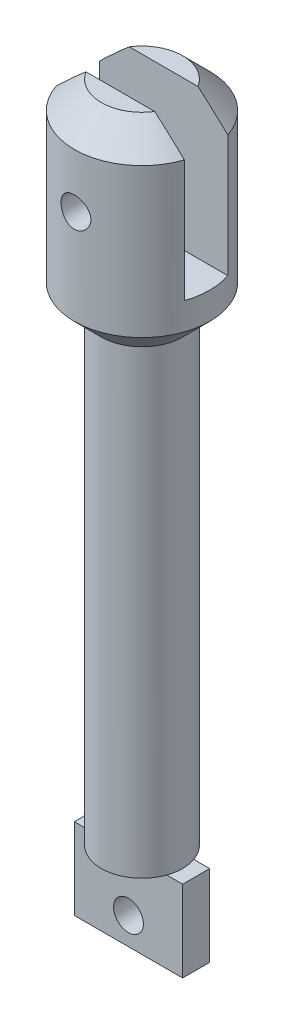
ISO-10303-21;
HEADER;
FILE_DESCRIPTION(('STEP AP214'),'2;1');
FILE_NAME('part.step','',(''),(''),'','','');
FILE_SCHEMA(('AUTOMOTIVE_DESIGN { 1 0 10303 214 1 1 1 1 }'));
ENDSEC;
DATA;
#1=APPLICATION_CONTEXT('core data for automotive mechanical design processes');
#2=APPLICATION_PROTOCOL_DEFINITION('international standard','automotive_design',2000,#1);
#3=PRODUCT_CONTEXT('',#1,'mechanical');
#4=PRODUCT('Part','Part','',(#3));
#5=PRODUCT_RELATED_PRODUCT_CATEGORY('part','',(#4));
#6=PRODUCT_DEFINITION_FORMATION('','',#4);
#7=PRODUCT_DEFINITION_CONTEXT('part definition',#1,'design');
#8=PRODUCT_DEFINITION('design','',#6,#7);
#9=PRODUCT_DEFINITION_SHAPE('','',#8);
#10=(LENGTH_UNIT() NAMED_UNIT(*) SI_UNIT(.MILLI.,.METRE.));
#11=(NAMED_UNIT(*) PLANE_ANGLE_UNIT() SI_UNIT($,.RADIAN.));
#12=(NAMED_UNIT(*) SI_UNIT($,.STERADIAN.) SOLID_ANGLE_UNIT());
#13=UNCERTAINTY_MEASURE_WITH_UNIT(LENGTH_MEASURE(1.E-05),#10,'distance_accuracy_value','');
#14=(GEOMETRIC_REPRESENTATION_CONTEXT(3) GLOBAL_UNCERTAINTY_ASSIGNED_CONTEXT((#13)) GLOBAL_UNIT_ASSIGNED_CONTEXT((#10,
#11,#12)) REPRESENTATION_CONTEXT('',''));
#15=CARTESIAN_POINT('',(0.,0.,0.));
#16=DIRECTION('',(0.,0.,1.));
#17=DIRECTION('',(1.,0.,0.));
#18=AXIS2_PLACEMENT_3D('',#15,#16,#17);
#19=CARTESIAN_POINT('',(0.,16.,0.));
#20=DIRECTION('',(0.,1.,0.));
#21=DIRECTION('',(0.,0.,1.));
#22=AXIS2_PLACEMENT_3D('',#19,#20,#21);
#23=PLANE('',#22);
#24=DIRECTION('',(1.,0.,0.));
#25=VECTOR('',#24,1.);
#26=CARTESIAN_POINT('',(-2.75,16.,0.8));
#27=LINE('',#26,#25);
#28=CARTESIAN_POINT('',(-1.26885775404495,16.,0.8));
#29=VERTEX_POINT('',#28);
#30=CARTESIAN_POINT('',(1.26885775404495,16.,0.8));
#31=VERTEX_POINT('',#30);
#32=EDGE_CURVE('E137',#29,#31,#27,.T.);
#33=ORIENTED_EDGE('',*,*,#32,.F.);
#34=CARTESIAN_POINT('',(0.,16.,0.));
#35=DIRECTION('',(0.,1.,0.));
#36=DIRECTION('',(0.,0.,1.));
#37=AXIS2_PLACEMENT_3D('',#34,#35,#36);
#38=CIRCLE('',#37,1.49999999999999);
#39=EDGE_CURVE('E141',#29,#31,#38,.T.);
#40=ORIENTED_EDGE('',*,*,#39,.T.);
#41=EDGE_LOOP('',(#33,#40));
#42=FACE_BOUND('',#41,.T.);
#43=ADVANCED_FACE('F32',(#42),#23,.T.);
#44=CARTESIAN_POINT('',(0.,16.,0.));
#45=DIRECTION('',(0.,-1.,0.));
#46=DIRECTION('',(0.,0.,-1.));
#47=AXIS2_PLACEMENT_3D('',#44,#45,#46);
#48=CONICAL_SURFACE('',#47,1.49999999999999,0.785398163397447);
#49=CARTESIAN_POINT('',(-5.50175266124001,11.9403882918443,0.8));
#50=CARTESIAN_POINT('',(-5.33857171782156,12.101863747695,0.8));
#51=CARTESIAN_POINT('',(-5.17532333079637,12.2632711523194,0.8));
#52=CARTESIAN_POINT('',(-4.8485497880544,12.5859637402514,0.8));
#53=CARTESIAN_POINT('',(-4.68502453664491,12.7472488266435,0.8));
#54=CARTESIAN_POINT('',(-4.35620866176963,13.071035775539,0.8));
#55=CARTESIAN_POINT('',(-4.19091562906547,13.2335351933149,0.8));
#56=CARTESIAN_POINT('',(-3.86003065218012,13.5580705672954,0.8));
#57=CARTESIAN_POINT('',(-3.69443888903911,13.7201067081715,0.8));
#58=CARTESIAN_POINT('',(-3.30405950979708,14.100842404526,0.8));
#59=CARTESIAN_POINT('',(-3.07904887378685,14.3193140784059,0.8));
#60=CARTESIAN_POINT('',(-2.73997447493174,14.6457832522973,0.8));
#61=CARTESIAN_POINT('',(-2.62659439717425,14.7544903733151,0.8));
#62=CARTESIAN_POINT('',(-2.39918779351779,14.9711862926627,0.8));
#63=CARTESIAN_POINT('',(-2.28516138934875,15.079175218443,0.8));
#64=CARTESIAN_POINT('',(-2.05692600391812,15.2933283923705,0.8));
#65=CARTESIAN_POINT('',(-1.94272407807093,15.3995001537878,0.8));
#66=CARTESIAN_POINT('',(-1.71269786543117,15.6102480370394,0.8));
#67=CARTESIAN_POINT('',(-1.59687250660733,15.7148229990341,0.8));
#68=CARTESIAN_POINT('',(-1.42130237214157,15.8692495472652,0.8));
#69=CARTESIAN_POINT('',(-1.36256436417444,15.9202433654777,0.8));
#70=CARTESIAN_POINT('',(-1.24417038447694,16.0211513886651,0.8));
#71=CARTESIAN_POINT('',(-1.18451447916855,16.0710656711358,0.8));
#72=CARTESIAN_POINT('',(-1.06398610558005,16.1692686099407,0.8));
#73=CARTESIAN_POINT('',(-1.00311506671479,16.217559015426,0.8));
#74=CARTESIAN_POINT('',(-0.879544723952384,16.3117309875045,0.8));
#75=CARTESIAN_POINT('',(-0.816846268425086,16.3576136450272,0.8));
#76=CARTESIAN_POINT('',(-0.735880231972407,16.4130906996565,0.8));
#77=CARTESIAN_POINT('',(-0.718880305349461,16.4245353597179,0.8));
#78=CARTESIAN_POINT('',(-0.684663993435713,16.4470998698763,0.8));
#79=CARTESIAN_POINT('',(-0.667447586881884,16.4582196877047,0.8));
#80=CARTESIAN_POINT('',(-0.615435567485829,16.4910228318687,0.8));
#81=CARTESIAN_POINT('',(-0.580282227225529,16.5121463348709,0.8));
#82=CARTESIAN_POINT('',(-0.509099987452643,16.552200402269,0.8));
#83=CARTESIAN_POINT('',(-0.473080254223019,16.5711470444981,0.8));
#84=CARTESIAN_POINT('',(-0.399723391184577,16.6062761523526,0.8));
#85=CARTESIAN_POINT('',(-0.362386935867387,16.6224600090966,0.8));
#86=CARTESIAN_POINT('',(-0.277278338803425,16.65443116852,0.8));
#87=CARTESIAN_POINT('',(-0.22911724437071,16.6692298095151,0.8));
#88=CARTESIAN_POINT('',(-0.131114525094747,16.6907193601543,0.8));
#89=CARTESIAN_POINT('',(-0.0812803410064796,16.6974422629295,0.8));
#90=CARTESIAN_POINT('',(0.0191115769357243,16.7013503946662,0.8));
#91=CARTESIAN_POINT('',(0.0696719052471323,16.6984737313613,0.8));
#92=CARTESIAN_POINT('',(0.169539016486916,16.6837433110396,0.8));
#93=CARTESIAN_POINT('',(0.218841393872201,16.6718615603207,0.8));
#94=CARTESIAN_POINT('',(0.305925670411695,16.6443014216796,0.8));
#95=CARTESIAN_POINT('',(0.344099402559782,16.6297929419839,0.8));
#96=CARTESIAN_POINT('',(0.419062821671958,16.5975207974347,0.8));
#97=CARTESIAN_POINT('',(0.45585127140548,16.5797543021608,0.8));
#98=CARTESIAN_POINT('',(0.528350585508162,16.5417747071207,0.8));
#99=CARTESIAN_POINT('',(0.564055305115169,16.5215500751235,0.8));
#100=CARTESIAN_POINT('',(0.634399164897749,16.4793768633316,0.8));
#101=CARTESIAN_POINT('',(0.669038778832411,16.4574290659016,0.8));
#102=CARTESIAN_POINT('',(0.744162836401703,16.4078314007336,0.8));
#103=CARTESIAN_POINT('',(0.784464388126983,16.37990623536,0.8));
#104=CARTESIAN_POINT('',(0.864124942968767,16.3227372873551,0.8));
#105=CARTESIAN_POINT('',(0.903483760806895,16.2934932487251,0.8));
#106=CARTESIAN_POINT('',(1.02051570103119,16.2042857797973,0.8));
#107=CARTESIAN_POINT('',(1.09708933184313,16.1428847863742,0.8));
#108=CARTESIAN_POINT('',(1.24856967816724,16.0177286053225,0.8));
#109=CARTESIAN_POINT('',(1.32347193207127,15.9539681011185,0.8));
#110=CARTESIAN_POINT('',(1.47200942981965,15.8250512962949,0.8));
#111=CARTESIAN_POINT('',(1.54564517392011,15.7598955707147,0.8));
#112=CARTESIAN_POINT('',(1.69226241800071,15.6284502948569,0.8));
#113=CARTESIAN_POINT('',(1.7652415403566,15.5621581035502,0.8));
#114=CARTESIAN_POINT('',(1.91058476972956,15.4288895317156,0.8));
#115=CARTESIAN_POINT('',(1.98294881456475,15.3619130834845,0.8));
#116=CARTESIAN_POINT('',(2.19914893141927,15.1604501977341,0.8));
#117=CARTESIAN_POINT('',(2.3423065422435,15.0252365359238,0.8));
#118=CARTESIAN_POINT('',(2.61305699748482,14.7674992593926,0.8));
#119=CARTESIAN_POINT('',(2.74075256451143,14.6450830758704,0.8));
#120=CARTESIAN_POINT('',(2.99556108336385,14.3996424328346,0.8));
#121=CARTESIAN_POINT('',(3.12267402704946,14.2766179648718,0.8));
#122=CARTESIAN_POINT('',(3.50355759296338,13.9067859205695,0.8));
#123=CARTESIAN_POINT('',(3.75672690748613,13.659359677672,0.8));
#124=CARTESIAN_POINT('',(4.25889848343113,13.166886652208,0.8));
#125=CARTESIAN_POINT('',(4.50791186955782,12.9218511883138,0.8));
#126=CARTESIAN_POINT('',(5.00524283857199,12.4313818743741,0.8));
#127=CARTESIAN_POINT('',(5.25356075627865,12.1859483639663,0.8));
#128=CARTESIAN_POINT('',(5.50175266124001,11.9403882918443,0.8));
#129=B_SPLINE_CURVE_WITH_KNOTS('',3,(#49,#50,#51,#52,#53,#54,#55,#56,#57,#58,#59,#60,#61,#62,
#63,#64,#65,#66,#67,#68,#69,#70,#71,#72,#73,#74,#75,#76,#77,#78,#79,#80,#81,#82,#83,#84,#85,#86,
#87,#88,#89,#90,#91,#92,#93,#94,#95,#96,#97,#98,#99,#100,#101,#102,#103,#104,#105,#106,#107,
#108,#109,#110,#111,#112,#113,#114,#115,#116,#117,#118,#119,#120,#121,#122,#123,#124,#125,#126,
#127,#128),.UNSPECIFIED.,.F.,.F.,(4,2,2,2,2,2,2,2,2,2,2,2,2,2,2,2,2,2,2,2,2,2,2,2,2,2,2,2,2,2,2,
2,2,2,2,2,2,2,2,4),(0.,0.68870980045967,1.37775281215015,2.07313025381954,2.76817470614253,
3.70903733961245,4.18025800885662,4.65139269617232,5.11917943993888,5.58729118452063,
5.82063833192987,6.05396867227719,6.28703905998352,6.5200029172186,6.58147970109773,
6.6429625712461,6.76594680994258,6.88795471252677,7.00990099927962,7.16053083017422,
7.31056193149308,7.46156220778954,7.61303382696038,7.73536955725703,7.85781207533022,
7.98085296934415,8.1038383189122,8.25089317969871,8.39797670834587,8.69234364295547,
8.98741994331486,9.28237688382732,9.57815095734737,9.87395458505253,10.4646970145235,
10.995380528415,11.5260714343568,12.5880601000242,13.6361292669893,14.6835509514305),.UNSPECIFIED.);
#130=CARTESIAN_POINT('',(-2.3685438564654,15.,0.8));
#131=VERTEX_POINT('',#130);
#132=EDGE_CURVE('E254',#131,#29,#129,.T.);
#133=ORIENTED_EDGE('',*,*,#132,.F.);
#134=CARTESIAN_POINT('',(0.,15.,0.));
#135=DIRECTION('',(0.,1.,0.));
#136=DIRECTION('',(0.,0.,1.));
#137=AXIS2_PLACEMENT_3D('',#134,#135,#136);
#138=CIRCLE('',#137,2.5);
#139=CARTESIAN_POINT('',(2.3685438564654,15.,0.8));
#140=VERTEX_POINT('',#139);
#141=EDGE_CURVE('E256',#140,#131,#138,.F.);
#142=ORIENTED_EDGE('',*,*,#141,.F.);
#143=EDGE_CURVE('E130',#31,#140,#129,.T.);
#144=ORIENTED_EDGE('',*,*,#143,.F.);
#145=ORIENTED_EDGE('',*,*,#39,.F.);
#146=EDGE_LOOP('',(#133,#142,#144,#145));
#147=FACE_BOUND('',#146,.T.);
#148=ADVANCED_FACE('F240',(#147),#48,.T.);
#149=CARTESIAN_POINT('',(0.,-8.5,0.));
#150=DIRECTION('',(0.,1.,0.));
#151=DIRECTION('',(0.,0.,1.));
#152=AXIS2_PLACEMENT_3D('',#149,#150,#151);
#153=PLANE('',#152);
#154=DIRECTION('',(-1.,0.,0.));
#155=VECTOR('',#154,1.);
#156=CARTESIAN_POINT('',(-2.,-8.5,0.5));
#157=LINE('',#156,#155);
#158=CARTESIAN_POINT('',(1.4142135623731,-8.5,0.5));
#159=VERTEX_POINT('',#158);
#160=CARTESIAN_POINT('',(-1.4142135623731,-8.5,0.5));
#161=VERTEX_POINT('',#160);
#162=EDGE_CURVE('E140',#159,#161,#157,.T.);
#163=ORIENTED_EDGE('',*,*,#162,.F.);
#164=CARTESIAN_POINT('',(0.,-8.5,0.));
#165=DIRECTION('',(0.,1.,0.));
#166=DIRECTION('',(0.,0.,1.));
#167=AXIS2_PLACEMENT_3D('',#164,#165,#166);
#168=CIRCLE('',#167,1.5);
#169=EDGE_CURVE('E306',#161,#159,#168,.T.);
#170=ORIENTED_EDGE('',*,*,#169,.F.);
#171=EDGE_LOOP('',(#163,#170));
#172=FACE_BOUND('',#171,.T.);
#173=ADVANCED_FACE('F245',(#172),#153,.F.);
#174=CARTESIAN_POINT('',(0.,8.5,0.));
#175=DIRECTION('',(0.,-1.,0.));
#176=DIRECTION('',(0.,0.,-1.));
#177=AXIS2_PLACEMENT_3D('',#174,#175,#176);
#178=CYLINDRICAL_SURFACE('',#177,1.5);
#179=CARTESIAN_POINT('',(0.,8.5,0.));
#180=DIRECTION('',(0.,1.,0.));
#181=DIRECTION('',(0.,0.,1.));
#182=AXIS2_PLACEMENT_3D('',#179,#180,#181);
#183=CIRCLE('',#182,1.5);
#184=CARTESIAN_POINT('',(0.,8.5,1.5));
#185=VERTEX_POINT('',#184);
#186=EDGE_CURVE('E307',#185,#185,#183,.T.);
#187=ORIENTED_EDGE('',*,*,#186,.F.);
#188=EDGE_LOOP('',(#187));
#189=FACE_BOUND('',#188,.T.);
#190=CARTESIAN_POINT('',(1.4142135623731,-8.5,-0.5));
#191=VERTEX_POINT('',#190);
#192=EDGE_CURVE('E310',#159,#191,#168,.T.);
#193=ORIENTED_EDGE('',*,*,#192,.T.);
#194=CARTESIAN_POINT('',(-1.4142135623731,-8.5,-0.5));
#195=VERTEX_POINT('',#194);
#196=EDGE_CURVE('E312',#191,#195,#168,.T.);
#197=ORIENTED_EDGE('',*,*,#196,.T.);
#198=EDGE_CURVE('E350',#195,#161,#168,.T.);
#199=ORIENTED_EDGE('',*,*,#198,.T.);
#200=ORIENTED_EDGE('',*,*,#169,.T.);
#201=EDGE_LOOP('',(#193,#197,#199,#200));
#202=FACE_BOUND('',#201,.T.);
#203=ADVANCED_FACE('F322',(#189,#202),#178,.T.);
#204=ORIENTED_EDGE('',*,*,#196,.F.);
#205=DIRECTION('',(-1.,0.,0.));
#206=VECTOR('',#205,1.);
#207=CARTESIAN_POINT('',(-2.,-8.5,-0.5));
#208=LINE('',#207,#206);
#209=EDGE_CURVE('E56',#191,#195,#208,.T.);
#210=ORIENTED_EDGE('',*,*,#209,.T.);
#211=EDGE_LOOP('',(#204,#210));
#212=FACE_BOUND('',#211,.T.);
#213=ADVANCED_FACE('F210',(#212),#153,.F.);
#214=CARTESIAN_POINT('',(0.,16.,0.));
#215=DIRECTION('',(0.,-1.,0.));
#216=DIRECTION('',(0.,0.,-1.));
#217=AXIS2_PLACEMENT_3D('',#214,#215,#216);
#218=CYLINDRICAL_SURFACE('',#217,2.5);
#219=CARTESIAN_POINT('',(0.,13.55,-2.5));
#220=CARTESIAN_POINT('',(-0.0304999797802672,13.5499989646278,-2.49999943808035));
#221=CARTESIAN_POINT('',(-0.0610124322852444,13.5474543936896,-2.49943618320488));
#222=CARTESIAN_POINT('',(-0.121170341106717,13.5373540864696,-2.49724365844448));
#223=CARTESIAN_POINT('',(-0.150815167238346,13.5297947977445,-2.49561363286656));
#224=CARTESIAN_POINT('',(-0.208359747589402,13.5099135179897,-2.49146901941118));
#225=CARTESIAN_POINT('',(-0.236261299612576,13.4975965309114,-2.48895536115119));
#226=CARTESIAN_POINT('',(-0.289600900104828,13.4685654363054,-2.48331463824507));
#227=CARTESIAN_POINT('',(-0.315039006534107,13.4518514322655,-2.48018758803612));
#228=CARTESIAN_POINT('',(-0.363143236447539,13.4142138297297,-2.47360580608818));
#229=CARTESIAN_POINT('',(-0.385763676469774,13.3932325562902,-2.47014697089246));
#230=CARTESIAN_POINT('',(-0.427194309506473,13.3477798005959,-2.46332030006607));
#231=CARTESIAN_POINT('',(-0.446004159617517,13.3233080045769,-2.45995247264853));
#232=CARTESIAN_POINT('',(-0.479481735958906,13.2712304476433,-2.45364864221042));
#233=CARTESIAN_POINT('',(-0.49410073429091,13.243592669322,-2.45071789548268));
#234=CARTESIAN_POINT('',(-0.518469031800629,13.1861775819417,-2.44567899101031));
#235=CARTESIAN_POINT('',(-0.528218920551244,13.1564005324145,-2.44357073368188));
#236=CARTESIAN_POINT('',(-0.542421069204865,13.0960479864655,-2.44045731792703));
#237=CARTESIAN_POINT('',(-0.54695426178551,13.0654924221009,-2.43943532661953));
#238=CARTESIAN_POINT('',(-0.550846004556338,13.0040386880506,-2.43855960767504));
#239=CARTESIAN_POINT('',(-0.550205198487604,12.9731405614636,-2.43870573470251));
#240=CARTESIAN_POINT('',(-0.543832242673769,12.9124811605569,-2.44013450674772));
#241=CARTESIAN_POINT('',(-0.538194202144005,12.8827094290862,-2.44139614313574));
#242=CARTESIAN_POINT('',(-0.522135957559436,12.8245450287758,-2.44488055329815));
#243=CARTESIAN_POINT('',(-0.51171548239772,12.7961524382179,-2.44710338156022));
#244=CARTESIAN_POINT('',(-0.486301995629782,12.7412881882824,-2.45228036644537));
#245=CARTESIAN_POINT('',(-0.471272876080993,12.7148338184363,-2.45524026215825));
#246=CARTESIAN_POINT('',(-0.437094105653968,12.664787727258,-2.4615543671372));
#247=CARTESIAN_POINT('',(-0.41794388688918,12.6411964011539,-2.46490863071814));
#248=CARTESIAN_POINT('',(-0.375568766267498,12.5970043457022,-2.47172360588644));
#249=CARTESIAN_POINT('',(-0.352263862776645,12.5764803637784,-2.47518504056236));
#250=CARTESIAN_POINT('',(-0.302503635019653,12.539619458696,-2.48175751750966));
#251=CARTESIAN_POINT('',(-0.276048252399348,12.5232826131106,-2.48486855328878));
#252=CARTESIAN_POINT('',(-0.220643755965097,12.4952404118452,-2.49039998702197));
#253=CARTESIAN_POINT('',(-0.191689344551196,12.4835452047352,-2.49281886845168));
#254=CARTESIAN_POINT('',(-0.132161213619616,12.4652075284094,-2.49668219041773));
#255=CARTESIAN_POINT('',(-0.101587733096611,12.4585643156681,-2.49812677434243));
#256=CARTESIAN_POINT('',(-0.0403475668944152,12.4506310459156,-2.49985829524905));
#257=CARTESIAN_POINT('',(-0.00969508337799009,12.4492361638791,-2.50016789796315));
#258=CARTESIAN_POINT('',(0.0514049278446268,12.4515548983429,-2.49965812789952));
#259=CARTESIAN_POINT('',(0.0818524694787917,12.4552681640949,-2.49883883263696));
#260=CARTESIAN_POINT('',(0.141330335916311,12.4676108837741,-2.49617763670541));
#261=CARTESIAN_POINT('',(0.170372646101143,12.4761852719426,-2.49434719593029));
#262=CARTESIAN_POINT('',(0.226606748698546,12.4979456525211,-2.48986862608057));
#263=CARTESIAN_POINT('',(0.253798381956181,12.5111320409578,-2.48722042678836));
#264=CARTESIAN_POINT('',(0.305992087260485,12.5419599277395,-2.48134423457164));
#265=CARTESIAN_POINT('',(0.330956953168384,12.5596628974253,-2.47810843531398));
#266=CARTESIAN_POINT('',(0.377599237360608,12.5989405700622,-2.47143175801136));
#267=CARTESIAN_POINT('',(0.399276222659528,12.6205157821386,-2.46799085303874));
#268=CARTESIAN_POINT('',(0.439142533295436,12.6674067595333,-2.46121335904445));
#269=CARTESIAN_POINT('',(0.457259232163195,12.6927848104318,-2.457879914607));
#270=CARTESIAN_POINT('',(0.488973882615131,12.7462848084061,-2.45176802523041));
#271=CARTESIAN_POINT('',(0.502572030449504,12.7744066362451,-2.44898955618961));
#272=CARTESIAN_POINT('',(0.524771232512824,12.832444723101,-2.44432893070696));
#273=CARTESIAN_POINT('',(0.533400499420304,12.8623497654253,-2.44244172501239));
#274=CARTESIAN_POINT('',(0.545499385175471,12.9232323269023,-2.4397683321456));
#275=CARTESIAN_POINT('',(0.548969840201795,12.9542096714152,-2.43898196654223));
#276=CARTESIAN_POINT('',(0.5506166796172,13.0156249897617,-2.43861062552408));
#277=CARTESIAN_POINT('',(0.548908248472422,13.0460597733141,-2.4389995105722));
#278=CARTESIAN_POINT('',(0.540503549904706,13.1061963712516,-2.44087568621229));
#279=CARTESIAN_POINT('',(0.533807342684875,13.1358981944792,-2.44236296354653));
#280=CARTESIAN_POINT('',(0.515673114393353,13.1936329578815,-2.44625553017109));
#281=CARTESIAN_POINT('',(0.504252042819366,13.2216714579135,-2.44865753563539));
#282=CARTESIAN_POINT('',(0.477006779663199,13.2754513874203,-2.45411016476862));
#283=CARTESIAN_POINT('',(0.461182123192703,13.3011925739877,-2.45716085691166));
#284=CARTESIAN_POINT('',(0.425197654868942,13.3502145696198,-2.46364507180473));
#285=CARTESIAN_POINT('',(0.404955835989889,13.3734343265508,-2.46708514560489));
#286=CARTESIAN_POINT('',(0.360877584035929,13.4161853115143,-2.47391669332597));
#287=CARTESIAN_POINT('',(0.337040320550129,13.4357156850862,-2.47730815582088));
#288=CARTESIAN_POINT('',(0.286069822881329,13.4707797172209,-2.48371329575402));
#289=CARTESIAN_POINT('',(0.258897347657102,13.4862574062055,-2.48672141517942));
#290=CARTESIAN_POINT('',(0.202275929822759,13.5124012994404,-2.4919650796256));
#291=CARTESIAN_POINT('',(0.172828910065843,13.5230715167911,-2.49420126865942));
#292=CARTESIAN_POINT('',(0.119462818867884,13.5374079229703,-2.49725270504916));
#293=CARTESIAN_POINT('',(0.0958312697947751,13.5421208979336,-2.49827653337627));
#294=CARTESIAN_POINT('',(0.0481357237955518,13.5484172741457,-2.49965038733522));
#295=CARTESIAN_POINT('',(0.0240717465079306,13.5500008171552,-2.5000004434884));
#296=CARTESIAN_POINT('',(0.,13.55,-2.5));
#297=B_SPLINE_CURVE_WITH_KNOTS('',3,(#219,#220,#221,#222,#223,#224,#225,#226,#227,#228,#229,
#230,#231,#232,#233,#234,#235,#236,#237,#238,#239,#240,#241,#242,#243,#244,#245,#246,#247,#248,
#249,#250,#251,#252,#253,#254,#255,#256,#257,#258,#259,#260,#261,#262,#263,#264,#265,#266,#267,
#268,#269,#270,#271,#272,#273,#274,#275,#276,#277,#278,#279,#280,#281,#282,#283,#284,#285,#286,
#287,#288,#289,#290,#291,#292,#293,#294,#295,#296),.UNSPECIFIED.,.T.,.F.,(4,2,2,2,2,2,2,2,2,2,2,
2,2,2,2,2,2,2,2,2,2,2,2,2,2,2,2,2,2,2,2,2,2,2,2,2,2,2,4),(0.,0.0914118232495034,
0.182888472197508,0.274269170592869,0.365647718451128,0.458354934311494,0.551070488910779,
0.644823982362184,0.738566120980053,0.83083344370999,0.923089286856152,1.01364380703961,
1.10420346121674,1.19549159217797,1.28679231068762,1.3800911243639,1.47339166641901,
1.56689509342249,1.66038475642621,1.75199692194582,1.84360279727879,1.93419114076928,
2.02478726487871,2.11668913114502,2.20860308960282,2.3022321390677,2.39585712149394,
2.488945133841,2.5820180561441,2.6730362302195,2.76405330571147,2.85474666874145,
2.94544960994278,3.03800671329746,3.13058522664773,3.22438187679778,3.3181000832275,
3.39024904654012,3.46239474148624),.UNSPECIFIED.);
#298=CARTESIAN_POINT('',(0.,13.55,-2.5));
#299=VERTEX_POINT('',#298);
#300=EDGE_CURVE('E138',#299,#299,#297,.T.);
#301=ORIENTED_EDGE('',*,*,#300,.T.);
#302=EDGE_LOOP('',(#301));
#303=FACE_BOUND('',#302,.T.);
#304=CARTESIAN_POINT('',(0.55,13.,2.43874967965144));
#305=CARTESIAN_POINT('',(0.549998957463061,12.9695100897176,2.43875029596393));
#306=CARTESIAN_POINT('',(0.547456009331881,12.9390076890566,2.43932769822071));
#307=CARTESIAN_POINT('',(0.537362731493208,12.8788706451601,2.44157061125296));
#308=CARTESIAN_POINT('',(0.529808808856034,12.8492366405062,2.44323690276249));
#309=CARTESIAN_POINT('',(0.509943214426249,12.7917149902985,2.4474599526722));
#310=CARTESIAN_POINT('',(0.497636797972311,12.7638254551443,2.45001572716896));
#311=CARTESIAN_POINT('',(0.468630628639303,12.7105061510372,2.45572858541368));
#312=CARTESIAN_POINT('',(0.451930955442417,12.685076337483,2.45888565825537));
#313=CARTESIAN_POINT('',(0.414308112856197,12.6369634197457,2.46550566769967));
#314=CARTESIAN_POINT('',(0.393324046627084,12.6143284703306,2.46897255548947));
#315=CARTESIAN_POINT('',(0.347859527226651,12.5728696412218,2.47578698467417));
#316=CARTESIAN_POINT('',(0.323378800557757,12.5540460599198,2.47913451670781));
#317=CARTESIAN_POINT('',(0.271292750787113,12.5205535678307,2.4853761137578));
#318=CARTESIAN_POINT('',(0.243656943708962,12.5059310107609,2.48826497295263));
#319=CARTESIAN_POINT('',(0.186246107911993,12.4815555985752,2.49321907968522));
#320=CARTESIAN_POINT('',(0.156471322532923,12.4718021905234,2.49528442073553));
#321=CARTESIAN_POINT('',(0.0961284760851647,12.4575935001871,2.49833086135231));
#322=CARTESIAN_POINT('',(0.0655804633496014,12.4530567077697,2.49932862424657));
#323=CARTESIAN_POINT('',(0.00414172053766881,12.4491551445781,2.50018523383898));
#324=CARTESIAN_POINT('',(-0.0267489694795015,12.4497897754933,2.50004421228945));
#325=CARTESIAN_POINT('',(-0.087434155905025,12.4561524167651,2.49865186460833));
#326=CARTESIAN_POINT('',(-0.117238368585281,12.4617925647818,2.49741969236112));
#327=CARTESIAN_POINT('',(-0.17546661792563,12.4778660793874,2.49400533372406));
#328=CARTESIAN_POINT('',(-0.203890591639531,12.4882996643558,2.49182310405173));
#329=CARTESIAN_POINT('',(-0.258794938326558,12.5137413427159,2.4867230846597));
#330=CARTESIAN_POINT('',(-0.285259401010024,12.5287826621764,2.48379997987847));
#331=CARTESIAN_POINT('',(-0.335320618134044,12.5629880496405,2.47753859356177));
#332=CARTESIAN_POINT('',(-0.358916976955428,12.5821526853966,2.47420025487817));
#333=CARTESIAN_POINT('',(-0.403094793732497,12.6245387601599,2.4673924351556));
#334=CARTESIAN_POINT('',(-0.423602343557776,12.6478370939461,2.46392167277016));
#335=CARTESIAN_POINT('',(-0.460433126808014,12.6975780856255,2.45730594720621));
#336=CARTESIAN_POINT('',(-0.476756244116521,12.7240208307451,2.4541609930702));
#337=CARTESIAN_POINT('',(-0.504788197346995,12.779420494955,2.44854953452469));
#338=CARTESIAN_POINT('',(-0.51648292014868,12.8083847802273,2.4460851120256));
#339=CARTESIAN_POINT('',(-0.534816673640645,12.8679345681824,2.44214249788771));
#340=CARTESIAN_POINT('',(-0.541456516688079,12.89851980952,2.44066414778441));
#341=CARTESIAN_POINT('',(-0.549377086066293,12.9597675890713,2.43889341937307));
#342=CARTESIAN_POINT('',(-0.550765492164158,12.9904155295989,2.43857721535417));
#343=CARTESIAN_POINT('',(-0.548435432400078,13.0515049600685,2.43910228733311));
#344=CARTESIAN_POINT('',(-0.544717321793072,13.0819464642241,2.43994348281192));
#345=CARTESIAN_POINT('',(-0.532373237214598,13.1413830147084,2.44266606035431));
#346=CARTESIAN_POINT('',(-0.523806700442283,13.1703910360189,2.4445348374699));
#347=CARTESIAN_POINT('',(-0.502073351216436,13.2265599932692,2.44909062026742));
#348=CARTESIAN_POINT('',(-0.488906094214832,13.2537207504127,2.45177770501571));
#349=CARTESIAN_POINT('',(-0.458108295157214,13.305889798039,2.45771959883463));
#350=CARTESIAN_POINT('',(-0.440411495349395,13.3308580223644,2.46098259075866));
#351=CARTESIAN_POINT('',(-0.401143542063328,13.3775099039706,2.4676871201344));
#352=CARTESIAN_POINT('',(-0.379571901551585,13.399193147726,2.47112867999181));
#353=CARTESIAN_POINT('',(-0.33267906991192,13.4390782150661,2.4778811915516));
#354=CARTESIAN_POINT('',(-0.307294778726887,13.4572065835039,2.48118845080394));
#355=CARTESIAN_POINT('',(-0.253778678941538,13.4889417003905,2.48723147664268));
#356=CARTESIAN_POINT('',(-0.225646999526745,13.502548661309,2.48996727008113));
#357=CARTESIAN_POINT('',(-0.167610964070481,13.5247527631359,2.49454356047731));
#358=CARTESIAN_POINT('',(-0.137719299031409,13.5333818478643,2.49638975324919));
#359=CARTESIAN_POINT('',(-0.0768653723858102,13.5454848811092,2.49900346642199));
#360=CARTESIAN_POINT('',(-0.0459032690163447,13.5489595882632,2.49977114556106));
#361=CARTESIAN_POINT('',(0.0155155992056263,13.5506207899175,2.5001365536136));
#362=CARTESIAN_POINT('',(0.0459693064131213,13.548916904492,2.49975853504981));
#363=CARTESIAN_POINT('',(0.106144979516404,13.5405147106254,2.49792705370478));
#364=CARTESIAN_POINT('',(0.135866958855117,13.5338164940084,2.49647361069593));
#365=CARTESIAN_POINT('',(0.193649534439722,13.5156685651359,2.49265646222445));
#366=CARTESIAN_POINT('',(0.221715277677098,13.5042345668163,2.49029576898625));
#367=CARTESIAN_POINT('',(0.275544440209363,13.4769549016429,2.48491606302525));
#368=CARTESIAN_POINT('',(0.301307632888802,13.4611088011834,2.48189698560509));
#369=CARTESIAN_POINT('',(0.350334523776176,13.4250981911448,2.47545742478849));
#370=CARTESIAN_POINT('',(0.37354081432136,13.4048566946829,2.47203035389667));
#371=CARTESIAN_POINT('',(0.416264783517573,13.3607849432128,2.46519630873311));
#372=CARTESIAN_POINT('',(0.435781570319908,13.3369538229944,2.46178933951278));
#373=CARTESIAN_POINT('',(0.470827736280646,13.2859905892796,2.45532969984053));
#374=CARTESIAN_POINT('',(0.486299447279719,13.2588180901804,2.45228246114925));
#375=CARTESIAN_POINT('',(0.512432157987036,13.2021972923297,2.44695576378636));
#376=CARTESIAN_POINT('',(0.523097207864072,13.1727509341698,2.44467565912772));
#377=CARTESIAN_POINT('',(0.537421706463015,13.1193978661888,2.44156049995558));
#378=CARTESIAN_POINT('',(0.542129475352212,13.095779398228,2.44051347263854));
#379=CARTESIAN_POINT('',(0.54841895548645,13.0481098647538,2.43910783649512));
#380=CARTESIAN_POINT('',(0.550000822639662,13.0240588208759,2.43874919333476));
#381=CARTESIAN_POINT('',(0.55,13.,2.43874967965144));
#382=B_SPLINE_CURVE_WITH_KNOTS('',3,(#304,#305,#306,#307,#308,#309,#310,#311,#312,#313,#314,
#315,#316,#317,#318,#319,#320,#321,#322,#323,#324,#325,#326,#327,#328,#329,#330,#331,#332,#333,
#334,#335,#336,#337,#338,#339,#340,#341,#342,#343,#344,#345,#346,#347,#348,#349,#350,#351,#352,
#353,#354,#355,#356,#357,#358,#359,#360,#361,#362,#363,#364,#365,#366,#367,#368,#369,#370,#371,
#372,#373,#374,#375,#376,#377,#378,#379,#380,#381),.UNSPECIFIED.,.T.,.F.,(4,2,2,2,2,2,2,2,2,2,2,
2,2,2,2,2,2,2,2,2,2,2,2,2,2,2,2,2,2,2,2,2,2,2,2,2,2,2,4),(0.,0.091381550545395,
0.182828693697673,0.274175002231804,0.365519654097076,0.458266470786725,0.551020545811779,
0.644761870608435,0.738492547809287,0.830737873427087,0.922972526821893,1.01361950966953,
1.10427062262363,1.19559144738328,1.2869248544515,1.38018057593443,1.473438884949,
1.56697941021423,1.66050489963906,1.75210193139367,1.84369259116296,1.93418402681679,
2.02468420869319,2.11659250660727,2.2085123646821,2.30216760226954,2.39581843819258,
2.48886141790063,2.5818907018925,2.67296456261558,2.7640367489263,2.85480913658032,
2.94559044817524,3.03811267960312,3.13065724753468,3.22445693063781,3.31817742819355,
3.3902879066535,3.46239478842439),.UNSPECIFIED.);
#383=CARTESIAN_POINT('',(0.55,13.,2.43874967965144));
#384=VERTEX_POINT('',#383);
#385=EDGE_CURVE('E215',#384,#384,#382,.T.);
#386=ORIENTED_EDGE('',*,*,#385,.T.);
#387=EDGE_LOOP('',(#386));
#388=FACE_BOUND('',#387,.T.);
#389=CARTESIAN_POINT('',(0.,10.5,0.));
#390=DIRECTION('',(0.,-1.,0.));
#391=DIRECTION('',(0.,0.,-1.));
#392=AXIS2_PLACEMENT_3D('',#389,#390,#391);
#393=CIRCLE('',#392,2.5);
#394=CARTESIAN_POINT('',(2.3685438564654,10.5,-0.8));
#395=VERTEX_POINT('',#394);
#396=CARTESIAN_POINT('',(2.3685438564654,10.5,0.8));
#397=VERTEX_POINT('',#396);
#398=EDGE_CURVE('E11',#395,#397,#393,.T.);
#399=ORIENTED_EDGE('',*,*,#398,.T.);
#400=DIRECTION('',(0.,-1.,0.));
#401=VECTOR('',#400,1.);
#402=CARTESIAN_POINT('',(2.3685438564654,16.,0.8));
#403=LINE('',#402,#401);
#404=EDGE_CURVE('E268',#397,#140,#403,.F.);
#405=ORIENTED_EDGE('',*,*,#404,.T.);
#406=ORIENTED_EDGE('',*,*,#141,.T.);
#407=DIRECTION('',(0.,-1.,0.));
#408=VECTOR('',#407,1.);
#409=CARTESIAN_POINT('',(-2.3685438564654,16.,0.8));
#410=LINE('',#409,#408);
#411=CARTESIAN_POINT('',(-2.3685438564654,10.5,0.8));
#412=VERTEX_POINT('',#411);
#413=EDGE_CURVE('E264',#131,#412,#410,.T.);
#414=ORIENTED_EDGE('',*,*,#413,.T.);
#415=CARTESIAN_POINT('',(-2.3685438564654,10.5,-0.8));
#416=VERTEX_POINT('',#415);
#417=EDGE_CURVE('E42',#412,#416,#393,.T.);
#418=ORIENTED_EDGE('',*,*,#417,.T.);
#419=DIRECTION('',(0.,-1.,0.));
#420=VECTOR('',#419,1.);
#421=CARTESIAN_POINT('',(-2.3685438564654,16.,-0.8));
#422=LINE('',#421,#420);
#423=CARTESIAN_POINT('',(-2.3685438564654,15.,-0.8));
#424=VERTEX_POINT('',#423);
#425=EDGE_CURVE('E263',#416,#424,#422,.F.);
#426=ORIENTED_EDGE('',*,*,#425,.T.);
#427=CARTESIAN_POINT('',(2.3685438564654,15.,-0.8));
#428=VERTEX_POINT('',#427);
#429=EDGE_CURVE('E313',#424,#428,#138,.F.);
#430=ORIENTED_EDGE('',*,*,#429,.T.);
#431=DIRECTION('',(0.,-1.,0.));
#432=VECTOR('',#431,1.);
#433=CARTESIAN_POINT('',(2.3685438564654,16.,-0.8));
#434=LINE('',#433,#432);
#435=EDGE_CURVE('E125',#428,#395,#434,.T.);
#436=ORIENTED_EDGE('',*,*,#435,.T.);
#437=EDGE_LOOP('',(#399,#405,#406,#414,#418,#426,#430,#436));
#438=FACE_BOUND('',#437,.T.);
#439=CARTESIAN_POINT('',(0.,9.5,0.));
#440=DIRECTION('',(0.,1.,0.));
#441=DIRECTION('',(0.,0.,1.));
#442=AXIS2_PLACEMENT_3D('',#439,#440,#441);
#443=CIRCLE('',#442,2.5);
#444=CARTESIAN_POINT('',(0.,9.5,2.5));
#445=VERTEX_POINT('',#444);
#446=EDGE_CURVE('E148',#445,#445,#443,.T.);
#447=ORIENTED_EDGE('',*,*,#446,.T.);
#448=EDGE_LOOP('',(#447));
#449=FACE_BOUND('',#448,.T.);
#450=ADVANCED_FACE('F206',(#303,#388,#438,#449),#218,.T.);
#451=DIRECTION('',(-1.,0.,0.));
#452=VECTOR('',#451,1.);
#453=CARTESIAN_POINT('',(-2.75,16.,-0.8));
#454=LINE('',#453,#452);
#455=CARTESIAN_POINT('',(1.26885775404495,16.,-0.8));
#456=VERTEX_POINT('',#455);
#457=CARTESIAN_POINT('',(-1.26885775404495,16.,-0.8));
#458=VERTEX_POINT('',#457);
#459=EDGE_CURVE('E49',#456,#458,#454,.T.);
#460=ORIENTED_EDGE('',*,*,#459,.F.);
#461=EDGE_CURVE('E136',#456,#458,#38,.T.);
#462=ORIENTED_EDGE('',*,*,#461,.T.);
#463=EDGE_LOOP('',(#460,#462));
#464=FACE_BOUND('',#463,.T.);
#465=ADVANCED_FACE('F135',(#464),#23,.T.);
#466=CARTESIAN_POINT('',(0.,9.5,0.));
#467=DIRECTION('',(0.,1.,0.));
#468=DIRECTION('',(0.,0.,1.));
#469=AXIS2_PLACEMENT_3D('',#466,#467,#468);
#470=CONICAL_SURFACE('',#469,2.5,0.785398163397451);
#471=ORIENTED_EDGE('',*,*,#186,.T.);
#472=EDGE_LOOP('',(#471));
#473=FACE_BOUND('',#472,.T.);
#474=ORIENTED_EDGE('',*,*,#446,.F.);
#475=EDGE_LOOP('',(#474));
#476=FACE_BOUND('',#475,.T.);
#477=ADVANCED_FACE('F205',(#473,#476),#470,.T.);
#478=CARTESIAN_POINT('',(5.50175266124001,11.9403882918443,-0.8));
#479=CARTESIAN_POINT('',(5.33857171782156,12.101863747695,-0.8));
#480=CARTESIAN_POINT('',(5.17532333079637,12.2632711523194,-0.8));
#481=CARTESIAN_POINT('',(4.8485497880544,12.5859637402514,-0.8));
#482=CARTESIAN_POINT('',(4.68502453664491,12.7472488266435,-0.8));
#483=CARTESIAN_POINT('',(4.35620866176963,13.071035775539,-0.8));
#484=CARTESIAN_POINT('',(4.19091562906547,13.2335351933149,-0.8));
#485=CARTESIAN_POINT('',(3.86003065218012,13.5580705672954,-0.8));
#486=CARTESIAN_POINT('',(3.69443888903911,13.7201067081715,-0.8));
#487=CARTESIAN_POINT('',(3.30405950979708,14.100842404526,-0.8));
#488=CARTESIAN_POINT('',(3.07904887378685,14.3193140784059,-0.8));
#489=CARTESIAN_POINT('',(2.73997447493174,14.6457832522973,-0.8));
#490=CARTESIAN_POINT('',(2.62659439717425,14.7544903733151,-0.8));
#491=CARTESIAN_POINT('',(2.39918779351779,14.9711862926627,-0.8));
#492=CARTESIAN_POINT('',(2.28516138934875,15.079175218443,-0.8));
#493=CARTESIAN_POINT('',(2.05692600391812,15.2933283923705,-0.8));
#494=CARTESIAN_POINT('',(1.94272407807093,15.3995001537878,-0.8));
#495=CARTESIAN_POINT('',(1.71269786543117,15.6102480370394,-0.8));
#496=CARTESIAN_POINT('',(1.59687250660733,15.7148229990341,-0.8));
#497=CARTESIAN_POINT('',(1.42130237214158,15.8692495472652,-0.8));
#498=CARTESIAN_POINT('',(1.36256436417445,15.9202433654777,-0.8));
#499=CARTESIAN_POINT('',(1.24417038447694,16.0211513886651,-0.8));
#500=CARTESIAN_POINT('',(1.18451447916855,16.0710656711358,-0.8));
#501=CARTESIAN_POINT('',(1.06398610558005,16.1692686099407,-0.8));
#502=CARTESIAN_POINT('',(1.00311506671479,16.217559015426,-0.8));
#503=CARTESIAN_POINT('',(0.879544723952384,16.3117309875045,-0.8));
#504=CARTESIAN_POINT('',(0.816846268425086,16.3576136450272,-0.8));
#505=CARTESIAN_POINT('',(0.735880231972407,16.4130906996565,-0.8));
#506=CARTESIAN_POINT('',(0.718880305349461,16.4245353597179,-0.8));
#507=CARTESIAN_POINT('',(0.684663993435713,16.4470998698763,-0.8));
#508=CARTESIAN_POINT('',(0.667447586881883,16.4582196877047,-0.8));
#509=CARTESIAN_POINT('',(0.615435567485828,16.4910228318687,-0.8));
#510=CARTESIAN_POINT('',(0.580282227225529,16.5121463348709,-0.8));
#511=CARTESIAN_POINT('',(0.509099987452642,16.552200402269,-0.8));
#512=CARTESIAN_POINT('',(0.473080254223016,16.5711470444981,-0.8));
#513=CARTESIAN_POINT('',(0.399723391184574,16.6062761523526,-0.8));
#514=CARTESIAN_POINT('',(0.362386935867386,16.6224600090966,-0.8));
#515=CARTESIAN_POINT('',(0.277278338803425,16.65443116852,-0.8));
#516=CARTESIAN_POINT('',(0.22911724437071,16.6692298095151,-0.8));
#517=CARTESIAN_POINT('',(0.131114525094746,16.6907193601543,-0.8));
#518=CARTESIAN_POINT('',(0.0812803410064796,16.6974422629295,-0.8));
#519=CARTESIAN_POINT('',(-0.0191115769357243,16.7013503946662,-0.8));
#520=CARTESIAN_POINT('',(-0.0696719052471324,16.6984737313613,-0.8));
#521=CARTESIAN_POINT('',(-0.169539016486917,16.6837433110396,-0.8));
#522=CARTESIAN_POINT('',(-0.218841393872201,16.6718615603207,-0.8));
#523=CARTESIAN_POINT('',(-0.305925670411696,16.6443014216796,-0.8));
#524=CARTESIAN_POINT('',(-0.344099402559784,16.6297929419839,-0.8));
#525=CARTESIAN_POINT('',(-0.419062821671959,16.5975207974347,-0.8));
#526=CARTESIAN_POINT('',(-0.455851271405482,16.5797543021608,-0.8));
#527=CARTESIAN_POINT('',(-0.528350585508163,16.5417747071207,-0.8));
#528=CARTESIAN_POINT('',(-0.564055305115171,16.5215500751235,-0.8));
#529=CARTESIAN_POINT('',(-0.634399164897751,16.4793768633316,-0.8));
#530=CARTESIAN_POINT('',(-0.669038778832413,16.4574290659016,-0.8));
#531=CARTESIAN_POINT('',(-0.744162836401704,16.4078314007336,-0.8));
#532=CARTESIAN_POINT('',(-0.784464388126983,16.37990623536,-0.8));
#533=CARTESIAN_POINT('',(-0.864124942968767,16.3227372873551,-0.8));
#534=CARTESIAN_POINT('',(-0.903483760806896,16.2934932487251,-0.8));
#535=CARTESIAN_POINT('',(-1.02051570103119,16.2042857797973,-0.8));
#536=CARTESIAN_POINT('',(-1.09708933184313,16.1428847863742,-0.8));
#537=CARTESIAN_POINT('',(-1.24856967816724,16.0177286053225,-0.8));
#538=CARTESIAN_POINT('',(-1.32347193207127,15.9539681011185,-0.8));
#539=CARTESIAN_POINT('',(-1.47200942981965,15.8250512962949,-0.8));
#540=CARTESIAN_POINT('',(-1.54564517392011,15.7598955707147,-0.8));
#541=CARTESIAN_POINT('',(-1.69226241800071,15.6284502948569,-0.8));
#542=CARTESIAN_POINT('',(-1.7652415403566,15.5621581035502,-0.8));
#543=CARTESIAN_POINT('',(-1.91058476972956,15.4288895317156,-0.8));
#544=CARTESIAN_POINT('',(-1.98294881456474,15.3619130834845,-0.8));
#545=CARTESIAN_POINT('',(-2.19914893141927,15.1604501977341,-0.8));
#546=CARTESIAN_POINT('',(-2.3423065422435,15.0252365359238,-0.8));
#547=CARTESIAN_POINT('',(-2.61305699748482,14.7674992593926,-0.8));
#548=CARTESIAN_POINT('',(-2.74075256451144,14.6450830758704,-0.8));
#549=CARTESIAN_POINT('',(-2.99556108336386,14.3996424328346,-0.8));
#550=CARTESIAN_POINT('',(-3.12267402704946,14.2766179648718,-0.8));
#551=CARTESIAN_POINT('',(-3.50355759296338,13.9067859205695,-0.8));
#552=CARTESIAN_POINT('',(-3.75672690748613,13.659359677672,-0.8));
#553=CARTESIAN_POINT('',(-4.25889848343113,13.166886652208,-0.8));
#554=CARTESIAN_POINT('',(-4.50791186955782,12.9218511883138,-0.8));
#555=CARTESIAN_POINT('',(-5.00524283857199,12.4313818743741,-0.8));
#556=CARTESIAN_POINT('',(-5.25356075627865,12.1859483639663,-0.8));
#557=CARTESIAN_POINT('',(-5.50175266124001,11.9403882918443,-0.8));
#558=B_SPLINE_CURVE_WITH_KNOTS('',3,(#478,#479,#480,#481,#482,#483,#484,#485,#486,#487,#488,
#489,#490,#491,#492,#493,#494,#495,#496,#497,#498,#499,#500,#501,#502,#503,#504,#505,#506,#507,
#508,#509,#510,#511,#512,#513,#514,#515,#516,#517,#518,#519,#520,#521,#522,#523,#524,#525,#526,
#527,#528,#529,#530,#531,#532,#533,#534,#535,#536,#537,#538,#539,#540,#541,#542,#543,#544,#545,
#546,#547,#548,#549,#550,#551,#552,#553,#554,#555,#556,#557),.UNSPECIFIED.,.F.,.F.,(4,2,2,2,2,2,
2,2,2,2,2,2,2,2,2,2,2,2,2,2,2,2,2,2,2,2,2,2,2,2,2,2,2,2,2,2,2,2,2,4),(0.,0.688709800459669,
1.37775281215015,2.07313025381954,2.76817470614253,3.70903733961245,4.18025800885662,
4.65139269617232,5.11917943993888,5.58729118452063,5.82063833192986,6.05396867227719,
6.28703905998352,6.5200029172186,6.58147970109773,6.6429625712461,6.76594680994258,
6.88795471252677,7.00990099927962,7.16053083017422,7.31056193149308,7.46156220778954,
7.61303382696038,7.73536955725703,7.85781207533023,7.98085296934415,8.1038383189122,
8.25089317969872,8.39797670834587,8.69234364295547,8.98741994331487,9.28237688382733,
9.57815095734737,9.87395458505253,10.4646970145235,10.995380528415,11.5260714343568,
12.5880601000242,13.6361292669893,14.6835509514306),.UNSPECIFIED.);
#559=EDGE_CURVE('E121',#428,#456,#558,.T.);
#560=ORIENTED_EDGE('',*,*,#559,.F.);
#561=ORIENTED_EDGE('',*,*,#429,.F.);
#562=EDGE_CURVE('E131',#458,#424,#558,.T.);
#563=ORIENTED_EDGE('',*,*,#562,.F.);
#564=ORIENTED_EDGE('',*,*,#461,.F.);
#565=EDGE_LOOP('',(#560,#561,#563,#564));
#566=FACE_BOUND('',#565,.T.);
#567=ADVANCED_FACE('F34',(#566),#48,.T.);
#568=CARTESIAN_POINT('',(-2.,-8.5,0.5));
#569=DIRECTION('',(0.,-1.,0.));
#570=DIRECTION('',(0.,0.,-1.));
#571=AXIS2_PLACEMENT_3D('',#568,#569,#570);
#572=PLANE('',#571);
#573=ORIENTED_EDGE('',*,*,#192,.F.);
#574=CARTESIAN_POINT('',(2.,-8.5,0.5));
#575=VERTEX_POINT('',#574);
#576=EDGE_CURVE('E145',#575,#159,#157,.T.);
#577=ORIENTED_EDGE('',*,*,#576,.F.);
#578=DIRECTION('',(0.,0.,-1.));
#579=VECTOR('',#578,1.);
#580=CARTESIAN_POINT('',(2.,-8.5,0.5));
#581=LINE('',#580,#579);
#582=CARTESIAN_POINT('',(2.,-8.5,-0.5));
#583=VERTEX_POINT('',#582);
#584=EDGE_CURVE('E297',#575,#583,#581,.T.);
#585=ORIENTED_EDGE('',*,*,#584,.T.);
#586=EDGE_CURVE('E280',#583,#191,#208,.T.);
#587=ORIENTED_EDGE('',*,*,#586,.T.);
#588=EDGE_LOOP('',(#573,#577,#585,#587));
#589=FACE_BOUND('',#588,.T.);
#590=ADVANCED_FACE('F191',(#589),#572,.F.);
#591=CARTESIAN_POINT('',(-2.,-8.5,0.5));
#592=DIRECTION('',(1.,0.,0.));
#593=DIRECTION('',(0.,1.,0.));
#594=AXIS2_PLACEMENT_3D('',#591,#592,#593);
#595=PLANE('',#594);
#596=DIRECTION('',(0.,-1.,0.));
#597=VECTOR('',#596,1.);
#598=CARTESIAN_POINT('',(-2.,-8.5,-0.5));
#599=LINE('',#598,#597);
#600=CARTESIAN_POINT('',(-2.,-8.5,-0.5));
#601=VERTEX_POINT('',#600);
#602=CARTESIAN_POINT('',(-2.,-11.5,-0.5));
#603=VERTEX_POINT('',#602);
#604=EDGE_CURVE('E154',#601,#603,#599,.T.);
#605=ORIENTED_EDGE('',*,*,#604,.T.);
#606=DIRECTION('',(0.,0.,-1.));
#607=VECTOR('',#606,1.);
#608=CARTESIAN_POINT('',(-2.,-11.5,0.5));
#609=LINE('',#608,#607);
#610=CARTESIAN_POINT('',(-2.,-11.5,0.5));
#611=VERTEX_POINT('',#610);
#612=EDGE_CURVE('E303',#611,#603,#609,.T.);
#613=ORIENTED_EDGE('',*,*,#612,.F.);
#614=DIRECTION('',(0.,-1.,0.));
#615=VECTOR('',#614,1.);
#616=CARTESIAN_POINT('',(-2.,-8.5,0.5));
#617=LINE('',#616,#615);
#618=CARTESIAN_POINT('',(-2.,-8.5,0.5));
#619=VERTEX_POINT('',#618);
#620=EDGE_CURVE('E276',#619,#611,#617,.T.);
#621=ORIENTED_EDGE('',*,*,#620,.F.);
#622=DIRECTION('',(0.,0.,-1.));
#623=VECTOR('',#622,1.);
#624=CARTESIAN_POINT('',(-2.,-8.5,0.5));
#625=LINE('',#624,#623);
#626=EDGE_CURVE('E285',#619,#601,#625,.T.);
#627=ORIENTED_EDGE('',*,*,#626,.T.);
#628=EDGE_LOOP('',(#605,#613,#621,#627));
#629=FACE_BOUND('',#628,.T.);
#630=ADVANCED_FACE('F198',(#629),#595,.F.);
#631=CARTESIAN_POINT('',(-2.,-11.5,0.5));
#632=DIRECTION('',(0.,1.,0.));
#633=DIRECTION('',(0.,0.,1.));
#634=AXIS2_PLACEMENT_3D('',#631,#632,#633);
#635=PLANE('',#634);
#636=DIRECTION('',(1.,0.,0.));
#637=VECTOR('',#636,1.);
#638=CARTESIAN_POINT('',(-2.,-11.5,-0.5));
#639=LINE('',#638,#637);
#640=CARTESIAN_POINT('',(2.,-11.5,-0.5));
#641=VERTEX_POINT('',#640);
#642=EDGE_CURVE('E288',#603,#641,#639,.T.);
#643=ORIENTED_EDGE('',*,*,#642,.T.);
#644=DIRECTION('',(0.,0.,-1.));
#645=VECTOR('',#644,1.);
#646=CARTESIAN_POINT('',(2.,-11.5,0.5));
#647=LINE('',#646,#645);
#648=CARTESIAN_POINT('',(2.,-11.5,0.5));
#649=VERTEX_POINT('',#648);
#650=EDGE_CURVE('E300',#649,#641,#647,.T.);
#651=ORIENTED_EDGE('',*,*,#650,.F.);
#652=DIRECTION('',(1.,0.,0.));
#653=VECTOR('',#652,1.);
#654=CARTESIAN_POINT('',(-2.,-11.5,0.5));
#655=LINE('',#654,#653);
#656=EDGE_CURVE('E279',#611,#649,#655,.T.);
#657=ORIENTED_EDGE('',*,*,#656,.F.);
#658=ORIENTED_EDGE('',*,*,#612,.T.);
#659=EDGE_LOOP('',(#643,#651,#657,#658));
#660=FACE_BOUND('',#659,.T.);
#661=ADVANCED_FACE('F194',(#660),#635,.F.);
#662=CARTESIAN_POINT('',(2.,-8.5,0.5));
#663=DIRECTION('',(-1.,0.,0.));
#664=DIRECTION('',(0.,0.,1.));
#665=AXIS2_PLACEMENT_3D('',#662,#663,#664);
#666=PLANE('',#665);
#667=DIRECTION('',(0.,1.,0.));
#668=VECTOR('',#667,1.);
#669=CARTESIAN_POINT('',(2.,-8.5,-0.5));
#670=LINE('',#669,#668);
#671=EDGE_CURVE('E290',#641,#583,#670,.T.);
#672=ORIENTED_EDGE('',*,*,#671,.T.);
#673=ORIENTED_EDGE('',*,*,#584,.F.);
#674=DIRECTION('',(0.,1.,0.));
#675=VECTOR('',#674,1.);
#676=CARTESIAN_POINT('',(2.,-8.5,0.5));
#677=LINE('',#676,#675);
#678=EDGE_CURVE('E282',#649,#575,#677,.T.);
#679=ORIENTED_EDGE('',*,*,#678,.F.);
#680=ORIENTED_EDGE('',*,*,#650,.T.);
#681=EDGE_LOOP('',(#672,#673,#679,#680));
#682=FACE_BOUND('',#681,.T.);
#683=ADVANCED_FACE('F189',(#682),#666,.F.);
#684=ORIENTED_EDGE('',*,*,#198,.F.);
#685=EDGE_CURVE('E292',#195,#601,#208,.T.);
#686=ORIENTED_EDGE('',*,*,#685,.T.);
#687=ORIENTED_EDGE('',*,*,#626,.F.);
#688=EDGE_CURVE('E146',#161,#619,#157,.T.);
#689=ORIENTED_EDGE('',*,*,#688,.F.);
#690=EDGE_LOOP('',(#684,#686,#687,#689));
#691=FACE_BOUND('',#690,.T.);
#692=ADVANCED_FACE('F182',(#691),#572,.F.);
#693=CARTESIAN_POINT('',(0.,0.,0.5));
#694=DIRECTION('',(0.,0.,1.));
#695=DIRECTION('',(1.,0.,0.));
#696=AXIS2_PLACEMENT_3D('',#693,#694,#695);
#697=PLANE('',#696);
#698=CARTESIAN_POINT('',(0.,-10.5,0.5));
#699=DIRECTION('',(0.,0.,1.));
#700=DIRECTION('',(1.,0.,0.));
#701=AXIS2_PLACEMENT_3D('',#698,#699,#700);
#702=CIRCLE('',#701,0.55);
#703=CARTESIAN_POINT('',(0.55,-10.5,0.5));
#704=VERTEX_POINT('',#703);
#705=EDGE_CURVE('E155',#704,#704,#702,.T.);
#706=ORIENTED_EDGE('',*,*,#705,.F.);
#707=EDGE_LOOP('',(#706));
#708=FACE_BOUND('',#707,.T.);
#709=ORIENTED_EDGE('',*,*,#620,.T.);
#710=ORIENTED_EDGE('',*,*,#656,.T.);
#711=ORIENTED_EDGE('',*,*,#678,.T.);
#712=ORIENTED_EDGE('',*,*,#576,.T.);
#713=ORIENTED_EDGE('',*,*,#162,.T.);
#714=ORIENTED_EDGE('',*,*,#688,.T.);
#715=EDGE_LOOP('',(#709,#710,#711,#712,#713,#714));
#716=FACE_BOUND('',#715,.T.);
#717=ADVANCED_FACE('F179',(#708,#716),#697,.T.);
#718=CARTESIAN_POINT('',(0.,0.,-0.5));
#719=DIRECTION('',(0.,0.,1.));
#720=DIRECTION('',(1.,0.,0.));
#721=AXIS2_PLACEMENT_3D('',#718,#719,#720);
#722=PLANE('',#721);
#723=CARTESIAN_POINT('',(0.,-10.5,-0.5));
#724=DIRECTION('',(0.,0.,1.));
#725=DIRECTION('',(1.,0.,0.));
#726=AXIS2_PLACEMENT_3D('',#723,#724,#725);
#727=CIRCLE('',#726,0.55);
#728=CARTESIAN_POINT('',(0.55,-10.5,-0.5));
#729=VERTEX_POINT('',#728);
#730=EDGE_CURVE('E152',#729,#729,#727,.T.);
#731=ORIENTED_EDGE('',*,*,#730,.T.);
#732=EDGE_LOOP('',(#731));
#733=FACE_BOUND('',#732,.T.);
#734=ORIENTED_EDGE('',*,*,#604,.F.);
#735=ORIENTED_EDGE('',*,*,#685,.F.);
#736=ORIENTED_EDGE('',*,*,#209,.F.);
#737=ORIENTED_EDGE('',*,*,#586,.F.);
#738=ORIENTED_EDGE('',*,*,#671,.F.);
#739=ORIENTED_EDGE('',*,*,#642,.F.);
#740=EDGE_LOOP('',(#734,#735,#736,#737,#738,#739));
#741=FACE_BOUND('',#740,.T.);
#742=ADVANCED_FACE('F177',(#733,#741),#722,.F.);
#743=CARTESIAN_POINT('',(0.,-10.5,-2.5));
#744=DIRECTION('',(0.,0.,1.));
#745=DIRECTION('',(1.,0.,0.));
#746=AXIS2_PLACEMENT_3D('',#743,#744,#745);
#747=CYLINDRICAL_SURFACE('',#746,0.55);
#748=ORIENTED_EDGE('',*,*,#705,.T.);
#749=EDGE_LOOP('',(#748));
#750=FACE_BOUND('',#749,.T.);
#751=ORIENTED_EDGE('',*,*,#730,.F.);
#752=EDGE_LOOP('',(#751));
#753=FACE_BOUND('',#752,.T.);
#754=ADVANCED_FACE('F173',(#750,#753),#747,.F.);
#755=CARTESIAN_POINT('',(0.,10.5,0.));
#756=DIRECTION('',(0.,-1.,0.));
#757=DIRECTION('',(0.,0.,-1.));
#758=AXIS2_PLACEMENT_3D('',#755,#756,#757);
#759=PLANE('',#758);
#760=DIRECTION('',(-1.,0.,0.));
#761=VECTOR('',#760,1.);
#762=CARTESIAN_POINT('',(-2.75,10.5,-0.8));
#763=LINE('',#762,#761);
#764=EDGE_CURVE('E225',#395,#416,#763,.T.);
#765=ORIENTED_EDGE('',*,*,#764,.T.);
#766=ORIENTED_EDGE('',*,*,#417,.F.);
#767=DIRECTION('',(1.,0.,0.));
#768=VECTOR('',#767,1.);
#769=CARTESIAN_POINT('',(-2.75,10.5,0.8));
#770=LINE('',#769,#768);
#771=EDGE_CURVE('E267',#412,#397,#770,.T.);
#772=ORIENTED_EDGE('',*,*,#771,.T.);
#773=ORIENTED_EDGE('',*,*,#398,.F.);
#774=EDGE_LOOP('',(#765,#766,#772,#773));
#775=FACE_BOUND('',#774,.T.);
#776=ADVANCED_FACE('F176',(#775),#759,.F.);
#777=CARTESIAN_POINT('',(-2.75,10.5,0.8));
#778=DIRECTION('',(0.,0.,1.));
#779=DIRECTION('',(1.,0.,0.));
#780=AXIS2_PLACEMENT_3D('',#777,#778,#779);
#781=PLANE('',#780);
#782=CARTESIAN_POINT('',(0.,13.,0.8));
#783=DIRECTION('',(0.,0.,1.));
#784=DIRECTION('',(1.,0.,0.));
#785=AXIS2_PLACEMENT_3D('',#782,#783,#784);
#786=CIRCLE('',#785,0.55);
#787=CARTESIAN_POINT('',(0.55,13.,0.8));
#788=VERTEX_POINT('',#787);
#789=EDGE_CURVE('E452',#788,#788,#786,.T.);
#790=ORIENTED_EDGE('',*,*,#789,.T.);
#791=EDGE_LOOP('',(#790));
#792=FACE_BOUND('',#791,.T.);
#793=ORIENTED_EDGE('',*,*,#132,.T.);
#794=ORIENTED_EDGE('',*,*,#32,.T.);
#795=ORIENTED_EDGE('',*,*,#143,.T.);
#796=ORIENTED_EDGE('',*,*,#404,.F.);
#797=ORIENTED_EDGE('',*,*,#771,.F.);
#798=ORIENTED_EDGE('',*,*,#413,.F.);
#799=EDGE_LOOP('',(#793,#794,#795,#796,#797,#798));
#800=FACE_BOUND('',#799,.T.);
#801=ADVANCED_FACE('F169',(#792,#800),#781,.F.);
#802=CARTESIAN_POINT('',(-2.75,10.5,-0.8));
#803=DIRECTION('',(0.,0.,-1.));
#804=DIRECTION('',(-1.,0.,0.));
#805=AXIS2_PLACEMENT_3D('',#802,#803,#804);
#806=PLANE('',#805);
#807=CARTESIAN_POINT('',(0.,13.,-0.8));
#808=DIRECTION('',(0.,0.,-1.));
#809=DIRECTION('',(-1.,0.,0.));
#810=AXIS2_PLACEMENT_3D('',#807,#808,#809);
#811=CIRCLE('',#810,0.55);
#812=CARTESIAN_POINT('',(-0.55,13.,-0.8));
#813=VERTEX_POINT('',#812);
#814=EDGE_CURVE('E37',#813,#813,#811,.T.);
#815=ORIENTED_EDGE('',*,*,#814,.T.);
#816=EDGE_LOOP('',(#815));
#817=FACE_BOUND('',#816,.T.);
#818=ORIENTED_EDGE('',*,*,#559,.T.);
#819=ORIENTED_EDGE('',*,*,#459,.T.);
#820=ORIENTED_EDGE('',*,*,#562,.T.);
#821=ORIENTED_EDGE('',*,*,#425,.F.);
#822=ORIENTED_EDGE('',*,*,#764,.F.);
#823=ORIENTED_EDGE('',*,*,#435,.F.);
#824=EDGE_LOOP('',(#818,#819,#820,#821,#822,#823));
#825=FACE_BOUND('',#824,.T.);
#826=ADVANCED_FACE('F122',(#817,#825),#806,.F.);
#827=CARTESIAN_POINT('',(0.,13.,-2.5));
#828=DIRECTION('',(0.,0.,1.));
#829=DIRECTION('',(1.,0.,0.));
#830=AXIS2_PLACEMENT_3D('',#827,#828,#829);
#831=CYLINDRICAL_SURFACE('',#830,0.55);
#832=ORIENTED_EDGE('',*,*,#814,.F.);
#833=EDGE_LOOP('',(#832));
#834=FACE_BOUND('',#833,.T.);
#835=ORIENTED_EDGE('',*,*,#300,.F.);
#836=EDGE_LOOP('',(#835));
#837=FACE_BOUND('',#836,.T.);
#838=ADVANCED_FACE('F168',(#834,#837),#831,.F.);
#839=ORIENTED_EDGE('',*,*,#789,.F.);
#840=EDGE_LOOP('',(#839));
#841=FACE_BOUND('',#840,.T.);
#842=ORIENTED_EDGE('',*,*,#385,.F.);
#843=EDGE_LOOP('',(#842));
#844=FACE_BOUND('',#843,.T.);
#845=ADVANCED_FACE('F229',(#841,#844),#831,.F.);
#846=CLOSED_SHELL('',(#43,#148,#173,#203,#213,#450,#465,#477,#567,#590,#630,#661,#683,#692,#717,
#742,#754,#776,#801,#826,#838,#845));
#847=MANIFOLD_SOLID_BREP('B2',#846);
#848=ADVANCED_BREP_SHAPE_REPRESENTATION('',(#18,#847),#14);
#849=SHAPE_DEFINITION_REPRESENTATION(#9,#848);
ENDSEC;
END-ISO-10303-21;
